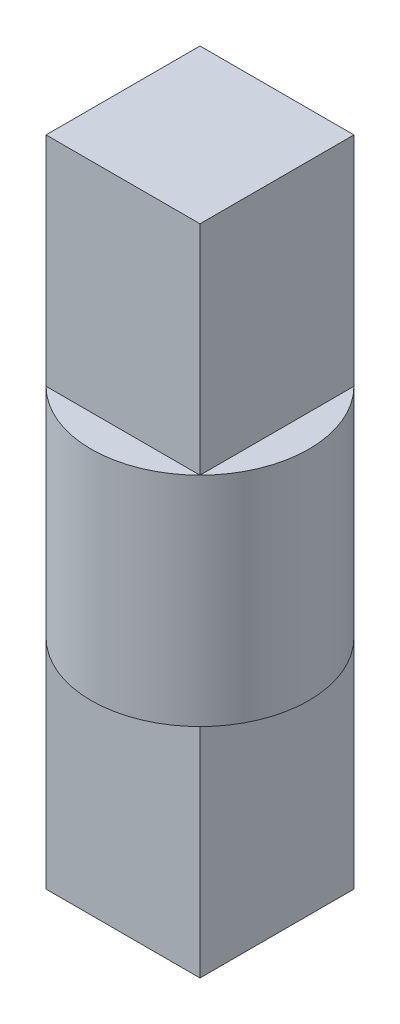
ISO-10303-21;
HEADER;
FILE_DESCRIPTION(('STEP AP214'),'2;1');
FILE_NAME('part.step','',(''),(''),'','','');
FILE_SCHEMA(('AUTOMOTIVE_DESIGN { 1 0 10303 214 1 1 1 1 }'));
ENDSEC;
DATA;
#1=APPLICATION_CONTEXT('core data for automotive mechanical design processes');
#2=APPLICATION_PROTOCOL_DEFINITION('international standard','automotive_design',2000,#1);
#3=PRODUCT_CONTEXT('',#1,'mechanical');
#4=PRODUCT('Part','Part','',(#3));
#5=PRODUCT_RELATED_PRODUCT_CATEGORY('part','',(#4));
#6=PRODUCT_DEFINITION_FORMATION('','',#4);
#7=PRODUCT_DEFINITION_CONTEXT('part definition',#1,'design');
#8=PRODUCT_DEFINITION('design','',#6,#7);
#9=PRODUCT_DEFINITION_SHAPE('','',#8);
#10=(LENGTH_UNIT() NAMED_UNIT(*) SI_UNIT(.MILLI.,.METRE.));
#11=(NAMED_UNIT(*) PLANE_ANGLE_UNIT() SI_UNIT($,.RADIAN.));
#12=(NAMED_UNIT(*) SI_UNIT($,.STERADIAN.) SOLID_ANGLE_UNIT());
#13=UNCERTAINTY_MEASURE_WITH_UNIT(LENGTH_MEASURE(1.E-05),#10,'distance_accuracy_value','');
#14=(GEOMETRIC_REPRESENTATION_CONTEXT(3) GLOBAL_UNCERTAINTY_ASSIGNED_CONTEXT((#13)) GLOBAL_UNIT_ASSIGNED_CONTEXT((#10,
#11,#12)) REPRESENTATION_CONTEXT('',''));
#15=CARTESIAN_POINT('',(0.,0.,0.));
#16=DIRECTION('',(0.,0.,1.));
#17=DIRECTION('',(1.,0.,0.));
#18=AXIS2_PLACEMENT_3D('',#15,#16,#17);
#19=CARTESIAN_POINT('',(0.353553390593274,-1.5,0.353553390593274));
#20=DIRECTION('',(1.,0.,0.));
#21=DIRECTION('',(0.,0.,-1.));
#22=AXIS2_PLACEMENT_3D('',#19,#20,#21);
#23=PLANE('',#22);
#24=DIRECTION('',(0.,1.,0.));
#25=VECTOR('',#24,1.);
#26=CARTESIAN_POINT('',(0.353553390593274,-1.5,-0.353553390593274));
#27=LINE('',#26,#25);
#28=CARTESIAN_POINT('',(0.353553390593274,-1.5,-0.353553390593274));
#29=VERTEX_POINT('',#28);
#30=CARTESIAN_POINT('',(0.353553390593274,-0.5,-0.353553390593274));
#31=VERTEX_POINT('',#30);
#32=EDGE_CURVE('E106',#29,#31,#27,.T.);
#33=ORIENTED_EDGE('',*,*,#32,.T.);
#34=DIRECTION('',(0.,0.,1.));
#35=VECTOR('',#34,1.);
#36=CARTESIAN_POINT('',(0.353553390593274,-0.5,0.353553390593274));
#37=LINE('',#36,#35);
#38=CARTESIAN_POINT('',(0.353553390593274,-0.5,0.353553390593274));
#39=VERTEX_POINT('',#38);
#40=EDGE_CURVE('E152',#31,#39,#37,.T.);
#41=ORIENTED_EDGE('',*,*,#40,.T.);
#42=DIRECTION('',(0.,1.,0.));
#43=VECTOR('',#42,1.);
#44=CARTESIAN_POINT('',(0.353553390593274,-1.5,0.353553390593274));
#45=LINE('',#44,#43);
#46=CARTESIAN_POINT('',(0.353553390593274,-1.5,0.353553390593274));
#47=VERTEX_POINT('',#46);
#48=EDGE_CURVE('E122',#47,#39,#45,.T.);
#49=ORIENTED_EDGE('',*,*,#48,.F.);
#50=DIRECTION('',(0.,0.,-1.));
#51=VECTOR('',#50,1.);
#52=CARTESIAN_POINT('',(0.353553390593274,-1.5,0.353553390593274));
#53=LINE('',#52,#51);
#54=EDGE_CURVE('E164',#47,#29,#53,.T.);
#55=ORIENTED_EDGE('',*,*,#54,.T.);
#56=EDGE_LOOP('',(#33,#41,#49,#55));
#57=FACE_BOUND('',#56,.T.);
#58=ADVANCED_FACE('F32',(#57),#23,.T.);
#59=CARTESIAN_POINT('',(-0.353553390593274,-1.5,0.353553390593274));
#60=DIRECTION('',(0.,0.,1.));
#61=DIRECTION('',(1.,0.,0.));
#62=AXIS2_PLACEMENT_3D('',#59,#60,#61);
#63=PLANE('',#62);
#64=ORIENTED_EDGE('',*,*,#48,.T.);
#65=DIRECTION('',(-1.,0.,0.));
#66=VECTOR('',#65,1.);
#67=CARTESIAN_POINT('',(-0.353553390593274,-0.5,0.353553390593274));
#68=LINE('',#67,#66);
#69=CARTESIAN_POINT('',(-0.353553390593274,-0.5,0.353553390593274));
#70=VERTEX_POINT('',#69);
#71=EDGE_CURVE('E149',#39,#70,#68,.T.);
#72=ORIENTED_EDGE('',*,*,#71,.T.);
#73=DIRECTION('',(0.,1.,0.));
#74=VECTOR('',#73,1.);
#75=CARTESIAN_POINT('',(-0.353553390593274,-1.5,0.353553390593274));
#76=LINE('',#75,#74);
#77=CARTESIAN_POINT('',(-0.353553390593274,-1.5,0.353553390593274));
#78=VERTEX_POINT('',#77);
#79=EDGE_CURVE('E177',#78,#70,#76,.T.);
#80=ORIENTED_EDGE('',*,*,#79,.F.);
#81=DIRECTION('',(1.,0.,0.));
#82=VECTOR('',#81,1.);
#83=CARTESIAN_POINT('',(-0.353553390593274,-1.5,0.353553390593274));
#84=LINE('',#83,#82);
#85=EDGE_CURVE('E107',#78,#47,#84,.T.);
#86=ORIENTED_EDGE('',*,*,#85,.T.);
#87=EDGE_LOOP('',(#64,#72,#80,#86));
#88=FACE_BOUND('',#87,.T.);
#89=ADVANCED_FACE('F203',(#88),#63,.T.);
#90=CARTESIAN_POINT('',(-0.353553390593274,-1.5,0.353553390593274));
#91=DIRECTION('',(-1.,0.,0.));
#92=DIRECTION('',(0.,0.,1.));
#93=AXIS2_PLACEMENT_3D('',#90,#91,#92);
#94=PLANE('',#93);
#95=ORIENTED_EDGE('',*,*,#79,.T.);
#96=DIRECTION('',(0.,0.,-1.));
#97=VECTOR('',#96,1.);
#98=CARTESIAN_POINT('',(-0.353553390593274,-0.5,0.353553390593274));
#99=LINE('',#98,#97);
#100=CARTESIAN_POINT('',(-0.353553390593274,-0.5,-0.353553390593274));
#101=VERTEX_POINT('',#100);
#102=EDGE_CURVE('E115',#70,#101,#99,.T.);
#103=ORIENTED_EDGE('',*,*,#102,.T.);
#104=DIRECTION('',(0.,1.,0.));
#105=VECTOR('',#104,1.);
#106=CARTESIAN_POINT('',(-0.353553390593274,-1.5,-0.353553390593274));
#107=LINE('',#106,#105);
#108=CARTESIAN_POINT('',(-0.353553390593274,-1.5,-0.353553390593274));
#109=VERTEX_POINT('',#108);
#110=EDGE_CURVE('E181',#109,#101,#107,.T.);
#111=ORIENTED_EDGE('',*,*,#110,.F.);
#112=DIRECTION('',(0.,0.,1.));
#113=VECTOR('',#112,1.);
#114=CARTESIAN_POINT('',(-0.353553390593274,-1.5,0.353553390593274));
#115=LINE('',#114,#113);
#116=EDGE_CURVE('E170',#109,#78,#115,.T.);
#117=ORIENTED_EDGE('',*,*,#116,.T.);
#118=EDGE_LOOP('',(#95,#103,#111,#117));
#119=FACE_BOUND('',#118,.T.);
#120=ADVANCED_FACE('F207',(#119),#94,.T.);
#121=CARTESIAN_POINT('',(-0.353553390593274,-1.5,-0.353553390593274));
#122=DIRECTION('',(0.,0.,-1.));
#123=DIRECTION('',(-1.,0.,0.));
#124=AXIS2_PLACEMENT_3D('',#121,#122,#123);
#125=PLANE('',#124);
#126=ORIENTED_EDGE('',*,*,#110,.T.);
#127=DIRECTION('',(1.,0.,0.));
#128=VECTOR('',#127,1.);
#129=CARTESIAN_POINT('',(-0.353553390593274,-0.5,-0.353553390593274));
#130=LINE('',#129,#128);
#131=EDGE_CURVE('E11',#101,#31,#130,.T.);
#132=ORIENTED_EDGE('',*,*,#131,.T.);
#133=ORIENTED_EDGE('',*,*,#32,.F.);
#134=DIRECTION('',(-1.,0.,0.));
#135=VECTOR('',#134,1.);
#136=CARTESIAN_POINT('',(-0.353553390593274,-1.5,-0.353553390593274));
#137=LINE('',#136,#135);
#138=EDGE_CURVE('E167',#29,#109,#137,.T.);
#139=ORIENTED_EDGE('',*,*,#138,.T.);
#140=EDGE_LOOP('',(#126,#132,#133,#139));
#141=FACE_BOUND('',#140,.T.);
#142=ADVANCED_FACE('F222',(#141),#125,.T.);
#143=CARTESIAN_POINT('',(0.,-1.5,0.));
#144=DIRECTION('',(0.,-1.,0.));
#145=DIRECTION('',(0.,0.,-1.));
#146=AXIS2_PLACEMENT_3D('',#143,#144,#145);
#147=PLANE('',#146);
#148=ORIENTED_EDGE('',*,*,#54,.F.);
#149=ORIENTED_EDGE('',*,*,#85,.F.);
#150=ORIENTED_EDGE('',*,*,#116,.F.);
#151=ORIENTED_EDGE('',*,*,#138,.F.);
#152=EDGE_LOOP('',(#148,#149,#150,#151));
#153=FACE_BOUND('',#152,.T.);
#154=ADVANCED_FACE('F219',(#153),#147,.T.);
#155=CARTESIAN_POINT('',(0.,-0.5,0.));
#156=DIRECTION('',(0.,1.,0.));
#157=DIRECTION('',(0.,0.,1.));
#158=AXIS2_PLACEMENT_3D('',#155,#156,#157);
#159=CYLINDRICAL_SURFACE('',#158,0.5);
#160=CARTESIAN_POINT('',(0.,0.5,0.));
#161=DIRECTION('',(0.,1.,0.));
#162=DIRECTION('',(0.,0.,1.));
#163=AXIS2_PLACEMENT_3D('',#160,#161,#162);
#164=CIRCLE('',#163,0.5);
#165=CARTESIAN_POINT('',(0.353553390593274,0.5,0.353553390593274));
#166=VERTEX_POINT('',#165);
#167=CARTESIAN_POINT('',(0.353553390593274,0.5,-0.353553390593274));
#168=VERTEX_POINT('',#167);
#169=EDGE_CURVE('E129',#166,#168,#164,.T.);
#170=ORIENTED_EDGE('',*,*,#169,.F.);
#171=CARTESIAN_POINT('',(-0.353553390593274,0.5,0.353553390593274));
#172=VERTEX_POINT('',#171);
#173=EDGE_CURVE('E135',#172,#166,#164,.T.);
#174=ORIENTED_EDGE('',*,*,#173,.F.);
#175=CARTESIAN_POINT('',(-0.353553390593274,0.5,-0.353553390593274));
#176=VERTEX_POINT('',#175);
#177=EDGE_CURVE('E131',#176,#172,#164,.T.);
#178=ORIENTED_EDGE('',*,*,#177,.F.);
#179=EDGE_CURVE('E121',#168,#176,#164,.T.);
#180=ORIENTED_EDGE('',*,*,#179,.F.);
#181=EDGE_LOOP('',(#170,#174,#178,#180));
#182=FACE_BOUND('',#181,.T.);
#183=CARTESIAN_POINT('',(0.,-0.5,0.));
#184=DIRECTION('',(0.,1.,0.));
#185=DIRECTION('',(0.,0.,1.));
#186=AXIS2_PLACEMENT_3D('',#183,#184,#185);
#187=CIRCLE('',#186,0.5);
#188=EDGE_CURVE('E134',#70,#39,#187,.T.);
#189=ORIENTED_EDGE('',*,*,#188,.T.);
#190=EDGE_CURVE('E139',#39,#31,#187,.T.);
#191=ORIENTED_EDGE('',*,*,#190,.T.);
#192=EDGE_CURVE('E145',#31,#101,#187,.T.);
#193=ORIENTED_EDGE('',*,*,#192,.T.);
#194=EDGE_CURVE('E137',#101,#70,#187,.T.);
#195=ORIENTED_EDGE('',*,*,#194,.T.);
#196=EDGE_LOOP('',(#189,#191,#193,#195));
#197=FACE_BOUND('',#196,.T.);
#198=ADVANCED_FACE('F126',(#182,#197),#159,.T.);
#199=CARTESIAN_POINT('',(0.,-0.5,0.));
#200=DIRECTION('',(0.,1.,0.));
#201=DIRECTION('',(0.,0.,1.));
#202=AXIS2_PLACEMENT_3D('',#199,#200,#201);
#203=PLANE('',#202);
#204=ORIENTED_EDGE('',*,*,#40,.F.);
#205=ORIENTED_EDGE('',*,*,#190,.F.);
#206=EDGE_LOOP('',(#204,#205));
#207=FACE_BOUND('',#206,.T.);
#208=ADVANCED_FACE('F248',(#207),#203,.F.);
#209=ORIENTED_EDGE('',*,*,#71,.F.);
#210=ORIENTED_EDGE('',*,*,#188,.F.);
#211=EDGE_LOOP('',(#209,#210));
#212=FACE_BOUND('',#211,.T.);
#213=ADVANCED_FACE('F240',(#212),#203,.F.);
#214=ORIENTED_EDGE('',*,*,#102,.F.);
#215=ORIENTED_EDGE('',*,*,#194,.F.);
#216=EDGE_LOOP('',(#214,#215));
#217=FACE_BOUND('',#216,.T.);
#218=ADVANCED_FACE('F200',(#217),#203,.F.);
#219=CARTESIAN_POINT('',(0.,0.5,0.));
#220=DIRECTION('',(0.,1.,0.));
#221=DIRECTION('',(0.,0.,1.));
#222=AXIS2_PLACEMENT_3D('',#219,#220,#221);
#223=PLANE('',#222);
#224=ORIENTED_EDGE('',*,*,#169,.T.);
#225=DIRECTION('',(0.,0.,1.));
#226=VECTOR('',#225,1.);
#227=CARTESIAN_POINT('',(0.353553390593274,0.5,0.353553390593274));
#228=LINE('',#227,#226);
#229=EDGE_CURVE('E110',#168,#166,#228,.T.);
#230=ORIENTED_EDGE('',*,*,#229,.T.);
#231=EDGE_LOOP('',(#224,#230));
#232=FACE_BOUND('',#231,.T.);
#233=ADVANCED_FACE('F133',(#232),#223,.T.);
#234=ORIENTED_EDGE('',*,*,#173,.T.);
#235=DIRECTION('',(-1.,0.,0.));
#236=VECTOR('',#235,1.);
#237=CARTESIAN_POINT('',(-0.353553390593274,0.5,0.353553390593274));
#238=LINE('',#237,#236);
#239=EDGE_CURVE('E47',#166,#172,#238,.T.);
#240=ORIENTED_EDGE('',*,*,#239,.T.);
#241=EDGE_LOOP('',(#234,#240));
#242=FACE_BOUND('',#241,.T.);
#243=ADVANCED_FACE('F192',(#242),#223,.T.);
#244=ORIENTED_EDGE('',*,*,#177,.T.);
#245=DIRECTION('',(0.,0.,-1.));
#246=VECTOR('',#245,1.);
#247=CARTESIAN_POINT('',(-0.353553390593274,0.5,0.353553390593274));
#248=LINE('',#247,#246);
#249=EDGE_CURVE('E55',#172,#176,#248,.T.);
#250=ORIENTED_EDGE('',*,*,#249,.T.);
#251=EDGE_LOOP('',(#244,#250));
#252=FACE_BOUND('',#251,.T.);
#253=ADVANCED_FACE('F142',(#252),#223,.T.);
#254=ORIENTED_EDGE('',*,*,#131,.F.);
#255=ORIENTED_EDGE('',*,*,#192,.F.);
#256=EDGE_LOOP('',(#254,#255));
#257=FACE_BOUND('',#256,.T.);
#258=ADVANCED_FACE('F199',(#257),#203,.F.);
#259=ORIENTED_EDGE('',*,*,#179,.T.);
#260=DIRECTION('',(1.,0.,0.));
#261=VECTOR('',#260,1.);
#262=CARTESIAN_POINT('',(-0.353553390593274,0.5,-0.353553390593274));
#263=LINE('',#262,#261);
#264=EDGE_CURVE('E40',#176,#168,#263,.T.);
#265=ORIENTED_EDGE('',*,*,#264,.T.);
#266=EDGE_LOOP('',(#259,#265));
#267=FACE_BOUND('',#266,.T.);
#268=ADVANCED_FACE('F120',(#267),#223,.T.);
#269=CARTESIAN_POINT('',(0.,1.5,0.));
#270=DIRECTION('',(0.,-1.,0.));
#271=DIRECTION('',(0.,0.,-1.));
#272=AXIS2_PLACEMENT_3D('',#269,#270,#271);
#273=PLANE('',#272);
#274=DIRECTION('',(0.,0.,-1.));
#275=VECTOR('',#274,1.);
#276=CARTESIAN_POINT('',(0.353553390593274,1.5,0.353553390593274));
#277=LINE('',#276,#275);
#278=CARTESIAN_POINT('',(0.353553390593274,1.5,0.353553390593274));
#279=VERTEX_POINT('',#278);
#280=CARTESIAN_POINT('',(0.353553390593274,1.5,-0.353553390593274));
#281=VERTEX_POINT('',#280);
#282=EDGE_CURVE('E155',#279,#281,#277,.T.);
#283=ORIENTED_EDGE('',*,*,#282,.T.);
#284=DIRECTION('',(-1.,0.,0.));
#285=VECTOR('',#284,1.);
#286=CARTESIAN_POINT('',(-0.353553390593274,1.5,-0.353553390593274));
#287=LINE('',#286,#285);
#288=CARTESIAN_POINT('',(-0.353553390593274,1.5,-0.353553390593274));
#289=VERTEX_POINT('',#288);
#290=EDGE_CURVE('E102',#281,#289,#287,.T.);
#291=ORIENTED_EDGE('',*,*,#290,.T.);
#292=DIRECTION('',(0.,0.,1.));
#293=VECTOR('',#292,1.);
#294=CARTESIAN_POINT('',(-0.353553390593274,1.5,0.353553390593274));
#295=LINE('',#294,#293);
#296=CARTESIAN_POINT('',(-0.353553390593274,1.5,0.353553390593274));
#297=VERTEX_POINT('',#296);
#298=EDGE_CURVE('E158',#289,#297,#295,.T.);
#299=ORIENTED_EDGE('',*,*,#298,.T.);
#300=DIRECTION('',(1.,0.,0.));
#301=VECTOR('',#300,1.);
#302=CARTESIAN_POINT('',(-0.353553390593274,1.5,0.353553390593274));
#303=LINE('',#302,#301);
#304=EDGE_CURVE('E161',#297,#279,#303,.T.);
#305=ORIENTED_EDGE('',*,*,#304,.T.);
#306=EDGE_LOOP('',(#283,#291,#299,#305));
#307=FACE_BOUND('',#306,.T.);
#308=ADVANCED_FACE('F188',(#307),#273,.F.);
#309=ORIENTED_EDGE('',*,*,#264,.F.);
#310=EDGE_CURVE('E183',#176,#289,#107,.T.);
#311=ORIENTED_EDGE('',*,*,#310,.T.);
#312=ORIENTED_EDGE('',*,*,#290,.F.);
#313=EDGE_CURVE('E97',#168,#281,#27,.T.);
#314=ORIENTED_EDGE('',*,*,#313,.F.);
#315=EDGE_LOOP('',(#309,#311,#312,#314));
#316=FACE_BOUND('',#315,.T.);
#317=ADVANCED_FACE('F99',(#316),#125,.T.);
#318=ORIENTED_EDGE('',*,*,#249,.F.);
#319=EDGE_CURVE('E180',#172,#297,#76,.T.);
#320=ORIENTED_EDGE('',*,*,#319,.T.);
#321=ORIENTED_EDGE('',*,*,#298,.F.);
#322=ORIENTED_EDGE('',*,*,#310,.F.);
#323=EDGE_LOOP('',(#318,#320,#321,#322));
#324=FACE_BOUND('',#323,.T.);
#325=ADVANCED_FACE('F190',(#324),#94,.T.);
#326=ORIENTED_EDGE('',*,*,#239,.F.);
#327=EDGE_CURVE('E111',#166,#279,#45,.T.);
#328=ORIENTED_EDGE('',*,*,#327,.T.);
#329=ORIENTED_EDGE('',*,*,#304,.F.);
#330=ORIENTED_EDGE('',*,*,#319,.F.);
#331=EDGE_LOOP('',(#326,#328,#329,#330));
#332=FACE_BOUND('',#331,.T.);
#333=ADVANCED_FACE('F191',(#332),#63,.T.);
#334=ORIENTED_EDGE('',*,*,#229,.F.);
#335=ORIENTED_EDGE('',*,*,#313,.T.);
#336=ORIENTED_EDGE('',*,*,#282,.F.);
#337=ORIENTED_EDGE('',*,*,#327,.F.);
#338=EDGE_LOOP('',(#334,#335,#336,#337));
#339=FACE_BOUND('',#338,.T.);
#340=ADVANCED_FACE('F34',(#339),#23,.T.);
#341=CLOSED_SHELL('',(#58,#89,#120,#142,#154,#198,#208,#213,#218,#233,#243,#253,#258,#268,#308,
#317,#325,#333,#340));
#342=MANIFOLD_SOLID_BREP('B2',#341);
#343=ADVANCED_BREP_SHAPE_REPRESENTATION('',(#18,#342),#14);
#344=SHAPE_DEFINITION_REPRESENTATION(#9,#343);
ENDSEC;
END-ISO-10303-21;
